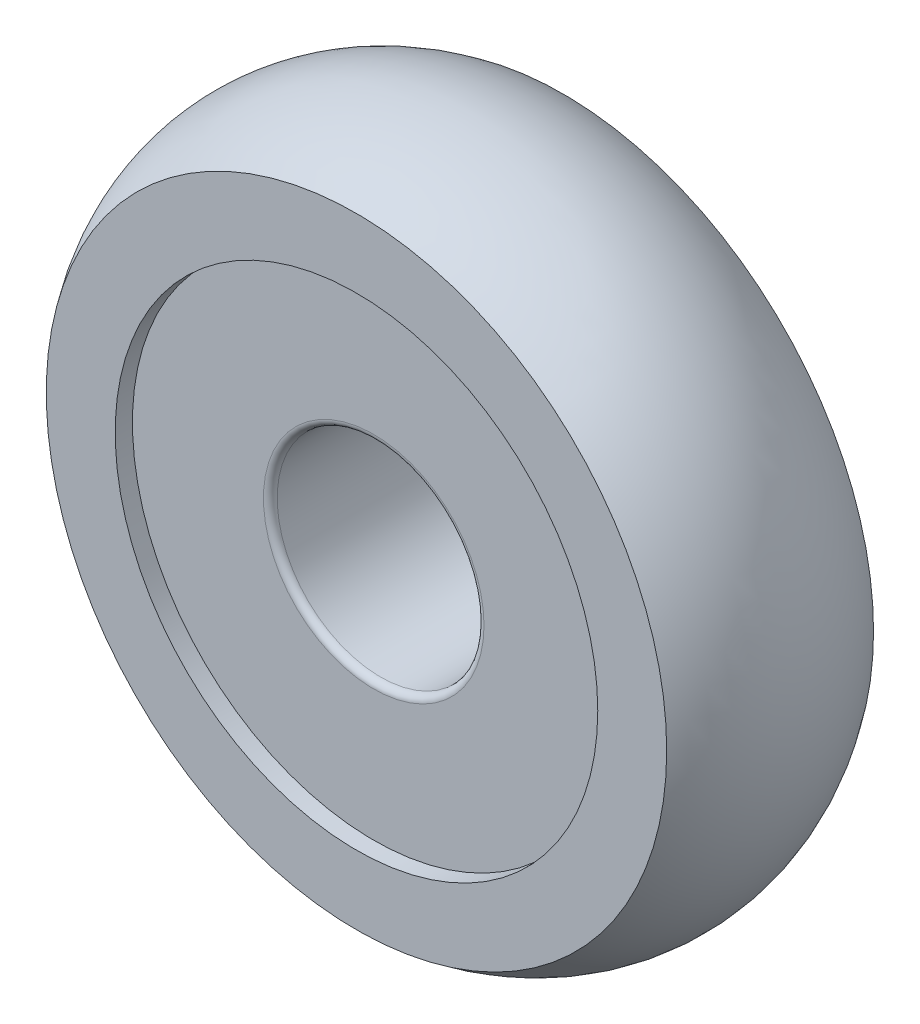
ISO-10303-21;
HEADER;
FILE_DESCRIPTION(('STEP AP214'),'2;1');
FILE_NAME('part.step','',(''),(''),'','','');
FILE_SCHEMA(('AUTOMOTIVE_DESIGN { 1 0 10303 214 1 1 1 1 }'));
ENDSEC;
DATA;
#1=APPLICATION_CONTEXT('core data for automotive mechanical design processes');
#2=APPLICATION_PROTOCOL_DEFINITION('international standard','automotive_design',2000,#1);
#3=PRODUCT_CONTEXT('',#1,'mechanical');
#4=PRODUCT('Part','Part','',(#3));
#5=PRODUCT_RELATED_PRODUCT_CATEGORY('part','',(#4));
#6=PRODUCT_DEFINITION_FORMATION('','',#4);
#7=PRODUCT_DEFINITION_CONTEXT('part definition',#1,'design');
#8=PRODUCT_DEFINITION('design','',#6,#7);
#9=PRODUCT_DEFINITION_SHAPE('','',#8);
#10=(LENGTH_UNIT() NAMED_UNIT(*) SI_UNIT(.MILLI.,.METRE.));
#11=(NAMED_UNIT(*) PLANE_ANGLE_UNIT() SI_UNIT($,.RADIAN.));
#12=(NAMED_UNIT(*) SI_UNIT($,.STERADIAN.) SOLID_ANGLE_UNIT());
#13=UNCERTAINTY_MEASURE_WITH_UNIT(LENGTH_MEASURE(1.E-05),#10,'distance_accuracy_value','');
#14=(GEOMETRIC_REPRESENTATION_CONTEXT(3) GLOBAL_UNCERTAINTY_ASSIGNED_CONTEXT((#13)) GLOBAL_UNIT_ASSIGNED_CONTEXT((#10,
#11,#12)) REPRESENTATION_CONTEXT('',''));
#15=CARTESIAN_POINT('',(0.,0.,0.));
#16=DIRECTION('',(0.,0.,1.));
#17=DIRECTION('',(1.,0.,0.));
#18=AXIS2_PLACEMENT_3D('',#15,#16,#17);
#19=CARTESIAN_POINT('',(0.,0.,2.30000000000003));
#20=DIRECTION('',(0.,0.,1.));
#21=DIRECTION('',(1.,0.,0.));
#22=AXIS2_PLACEMENT_3D('',#19,#20,#21);
#23=TOROIDAL_SURFACE('',#22,3.2,0.199999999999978);
#24=CARTESIAN_POINT('',(0.,0.,2.30000000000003));
#25=DIRECTION('',(0.,0.,1.));
#26=DIRECTION('',(1.,0.,0.));
#27=AXIS2_PLACEMENT_3D('',#24,#25,#26);
#28=CIRCLE('',#27,3.);
#29=CARTESIAN_POINT('',(3.,0.,2.30000000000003));
#30=VERTEX_POINT('',#29);
#31=EDGE_CURVE('E8',#30,#30,#28,.T.);
#32=ORIENTED_EDGE('',*,*,#31,.F.);
#33=EDGE_LOOP('',(#32));
#34=FACE_BOUND('',#33,.T.);
#35=CARTESIAN_POINT('',(0.,0.,2.5));
#36=DIRECTION('',(0.,0.,1.));
#37=DIRECTION('',(1.,0.,0.));
#38=AXIS2_PLACEMENT_3D('',#35,#36,#37);
#39=CIRCLE('',#38,3.2);
#40=CARTESIAN_POINT('',(3.2,0.,2.5));
#41=VERTEX_POINT('',#40);
#42=EDGE_CURVE('E46',#41,#41,#39,.T.);
#43=ORIENTED_EDGE('',*,*,#42,.T.);
#44=EDGE_LOOP('',(#43));
#45=FACE_BOUND('',#44,.T.);
#46=ADVANCED_FACE('F12',(#34,#45),#23,.T.);
#47=CARTESIAN_POINT('',(0.,0.,6.));
#48=DIRECTION('',(0.,0.,1.));
#49=DIRECTION('',(1.,0.,0.));
#50=AXIS2_PLACEMENT_3D('',#47,#48,#49);
#51=CYLINDRICAL_SURFACE('',#50,3.);
#52=CARTESIAN_POINT('',(0.,0.,-2.3));
#53=DIRECTION('',(0.,0.,1.));
#54=DIRECTION('',(1.,0.,0.));
#55=AXIS2_PLACEMENT_3D('',#52,#53,#54);
#56=CIRCLE('',#55,3.);
#57=CARTESIAN_POINT('',(3.,0.,-2.3));
#58=VERTEX_POINT('',#57);
#59=EDGE_CURVE('E18',#58,#58,#56,.T.);
#60=ORIENTED_EDGE('',*,*,#59,.F.);
#61=EDGE_LOOP('',(#60));
#62=FACE_BOUND('',#61,.T.);
#63=ORIENTED_EDGE('',*,*,#31,.T.);
#64=EDGE_LOOP('',(#63));
#65=FACE_BOUND('',#64,.T.);
#66=ADVANCED_FACE('F95',(#62,#65),#51,.F.);
#67=CARTESIAN_POINT('',(0.,0.,-2.3));
#68=DIRECTION('',(0.,0.,1.));
#69=DIRECTION('',(1.,0.,0.));
#70=AXIS2_PLACEMENT_3D('',#67,#68,#69);
#71=TOROIDAL_SURFACE('',#70,3.2,0.199999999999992);
#72=CARTESIAN_POINT('',(0.,0.,-2.5));
#73=DIRECTION('',(0.,0.,1.));
#74=DIRECTION('',(1.,0.,0.));
#75=AXIS2_PLACEMENT_3D('',#72,#73,#74);
#76=CIRCLE('',#75,3.2);
#77=CARTESIAN_POINT('',(3.2,0.,-2.5));
#78=VERTEX_POINT('',#77);
#79=EDGE_CURVE('E22',#78,#78,#76,.T.);
#80=ORIENTED_EDGE('',*,*,#79,.F.);
#81=EDGE_LOOP('',(#80));
#82=FACE_BOUND('',#81,.T.);
#83=ORIENTED_EDGE('',*,*,#59,.T.);
#84=EDGE_LOOP('',(#83));
#85=FACE_BOUND('',#84,.T.);
#86=ADVANCED_FACE('F90',(#82,#85),#71,.T.);
#87=CARTESIAN_POINT('',(0.,3.2,-2.5));
#88=DIRECTION('',(0.,0.,1.));
#89=DIRECTION('',(1.,0.,0.));
#90=AXIS2_PLACEMENT_3D('',#87,#88,#89);
#91=PLANE('',#90);
#92=CARTESIAN_POINT('',(0.,0.,-2.5));
#93=DIRECTION('',(0.,0.,1.));
#94=DIRECTION('',(1.,0.,0.));
#95=AXIS2_PLACEMENT_3D('',#92,#93,#94);
#96=CIRCLE('',#95,7.);
#97=CARTESIAN_POINT('',(7.,0.,-2.5));
#98=VERTEX_POINT('',#97);
#99=EDGE_CURVE('E26',#98,#98,#96,.T.);
#100=ORIENTED_EDGE('',*,*,#99,.F.);
#101=EDGE_LOOP('',(#100));
#102=FACE_BOUND('',#101,.T.);
#103=ORIENTED_EDGE('',*,*,#79,.T.);
#104=EDGE_LOOP('',(#103));
#105=FACE_BOUND('',#104,.T.);
#106=ADVANCED_FACE('F84',(#102,#105),#91,.F.);
#107=CARTESIAN_POINT('',(0.,0.,6.));
#108=DIRECTION('',(0.,0.,1.));
#109=DIRECTION('',(1.,0.,0.));
#110=AXIS2_PLACEMENT_3D('',#107,#108,#109);
#111=CYLINDRICAL_SURFACE('',#110,7.);
#112=CARTESIAN_POINT('',(0.,0.,-3.));
#113=DIRECTION('',(0.,0.,1.));
#114=DIRECTION('',(1.,0.,0.));
#115=AXIS2_PLACEMENT_3D('',#112,#113,#114);
#116=CIRCLE('',#115,7.);
#117=CARTESIAN_POINT('',(7.,0.,-3.));
#118=VERTEX_POINT('',#117);
#119=EDGE_CURVE('E31',#118,#118,#116,.T.);
#120=ORIENTED_EDGE('',*,*,#119,.F.);
#121=EDGE_LOOP('',(#120));
#122=FACE_BOUND('',#121,.T.);
#123=ORIENTED_EDGE('',*,*,#99,.T.);
#124=EDGE_LOOP('',(#123));
#125=FACE_BOUND('',#124,.T.);
#126=ADVANCED_FACE('F78',(#122,#125),#111,.F.);
#127=CARTESIAN_POINT('',(0.,9.,-3.));
#128=DIRECTION('',(0.,0.,1.));
#129=DIRECTION('',(1.,0.,0.));
#130=AXIS2_PLACEMENT_3D('',#127,#128,#129);
#131=PLANE('',#130);
#132=CARTESIAN_POINT('',(0.,0.,-3.));
#133=DIRECTION('',(0.,0.,1.));
#134=DIRECTION('',(1.,0.,0.));
#135=AXIS2_PLACEMENT_3D('',#132,#133,#134);
#136=CIRCLE('',#135,9.);
#137=CARTESIAN_POINT('',(9.,0.,-3.));
#138=VERTEX_POINT('',#137);
#139=EDGE_CURVE('E34',#138,#138,#136,.T.);
#140=ORIENTED_EDGE('',*,*,#139,.F.);
#141=EDGE_LOOP('',(#140));
#142=FACE_BOUND('',#141,.T.);
#143=ORIENTED_EDGE('',*,*,#119,.T.);
#144=EDGE_LOOP('',(#143));
#145=FACE_BOUND('',#144,.T.);
#146=ADVANCED_FACE('F72',(#142,#145),#131,.F.);
#147=CARTESIAN_POINT('',(0.,0.,0.));
#148=DIRECTION('',(0.,0.,1.));
#149=DIRECTION('',(1.,0.,0.));
#150=AXIS2_PLACEMENT_3D('',#147,#148,#149);
#151=DEGENERATE_TOROIDAL_SURFACE('',#150,5.,5.,.T.);
#152=CARTESIAN_POINT('',(0.,0.,3.));
#153=DIRECTION('',(0.,0.,1.));
#154=DIRECTION('',(1.,0.,0.));
#155=AXIS2_PLACEMENT_3D('',#152,#153,#154);
#156=CIRCLE('',#155,9.);
#157=CARTESIAN_POINT('',(9.,0.,3.));
#158=VERTEX_POINT('',#157);
#159=EDGE_CURVE('E37',#158,#158,#156,.T.);
#160=ORIENTED_EDGE('',*,*,#159,.F.);
#161=EDGE_LOOP('',(#160));
#162=FACE_BOUND('',#161,.T.);
#163=ORIENTED_EDGE('',*,*,#139,.T.);
#164=EDGE_LOOP('',(#163));
#165=FACE_BOUND('',#164,.T.);
#166=ADVANCED_FACE('F66',(#162,#165),#151,.T.);
#167=CARTESIAN_POINT('',(0.,9.,3.));
#168=DIRECTION('',(0.,0.,-1.));
#169=DIRECTION('',(-1.,0.,0.));
#170=AXIS2_PLACEMENT_3D('',#167,#168,#169);
#171=PLANE('',#170);
#172=CARTESIAN_POINT('',(0.,0.,3.));
#173=DIRECTION('',(0.,0.,1.));
#174=DIRECTION('',(1.,0.,0.));
#175=AXIS2_PLACEMENT_3D('',#172,#173,#174);
#176=CIRCLE('',#175,7.);
#177=CARTESIAN_POINT('',(7.,0.,3.));
#178=VERTEX_POINT('',#177);
#179=EDGE_CURVE('E40',#178,#178,#176,.T.);
#180=ORIENTED_EDGE('',*,*,#179,.F.);
#181=EDGE_LOOP('',(#180));
#182=FACE_BOUND('',#181,.T.);
#183=ORIENTED_EDGE('',*,*,#159,.T.);
#184=EDGE_LOOP('',(#183));
#185=FACE_BOUND('',#184,.T.);
#186=ADVANCED_FACE('F60',(#182,#185),#171,.F.);
#187=CARTESIAN_POINT('',(0.,0.,6.));
#188=DIRECTION('',(0.,0.,1.));
#189=DIRECTION('',(1.,0.,0.));
#190=AXIS2_PLACEMENT_3D('',#187,#188,#189);
#191=CYLINDRICAL_SURFACE('',#190,7.);
#192=CARTESIAN_POINT('',(0.,0.,2.5));
#193=DIRECTION('',(0.,0.,1.));
#194=DIRECTION('',(1.,0.,0.));
#195=AXIS2_PLACEMENT_3D('',#192,#193,#194);
#196=CIRCLE('',#195,7.);
#197=CARTESIAN_POINT('',(7.,0.,2.5));
#198=VERTEX_POINT('',#197);
#199=EDGE_CURVE('E43',#198,#198,#196,.T.);
#200=ORIENTED_EDGE('',*,*,#199,.F.);
#201=EDGE_LOOP('',(#200));
#202=FACE_BOUND('',#201,.T.);
#203=ORIENTED_EDGE('',*,*,#179,.T.);
#204=EDGE_LOOP('',(#203));
#205=FACE_BOUND('',#204,.T.);
#206=ADVANCED_FACE('F54',(#202,#205),#191,.F.);
#207=CARTESIAN_POINT('',(0.,3.2,2.5));
#208=DIRECTION('',(0.,0.,-1.));
#209=DIRECTION('',(-1.,0.,0.));
#210=AXIS2_PLACEMENT_3D('',#207,#208,#209);
#211=PLANE('',#210);
#212=ORIENTED_EDGE('',*,*,#42,.F.);
#213=EDGE_LOOP('',(#212));
#214=FACE_BOUND('',#213,.T.);
#215=ORIENTED_EDGE('',*,*,#199,.T.);
#216=EDGE_LOOP('',(#215));
#217=FACE_BOUND('',#216,.T.);
#218=ADVANCED_FACE('F51',(#214,#217),#211,.F.);
#219=CLOSED_SHELL('',(#46,#66,#86,#106,#126,#146,#166,#186,#206,#218));
#220=MANIFOLD_SOLID_BREP('B1',#219);
#221=ADVANCED_BREP_SHAPE_REPRESENTATION('',(#18,#220),#14);
#222=SHAPE_DEFINITION_REPRESENTATION(#9,#221);
ENDSEC;
END-ISO-10303-21;
